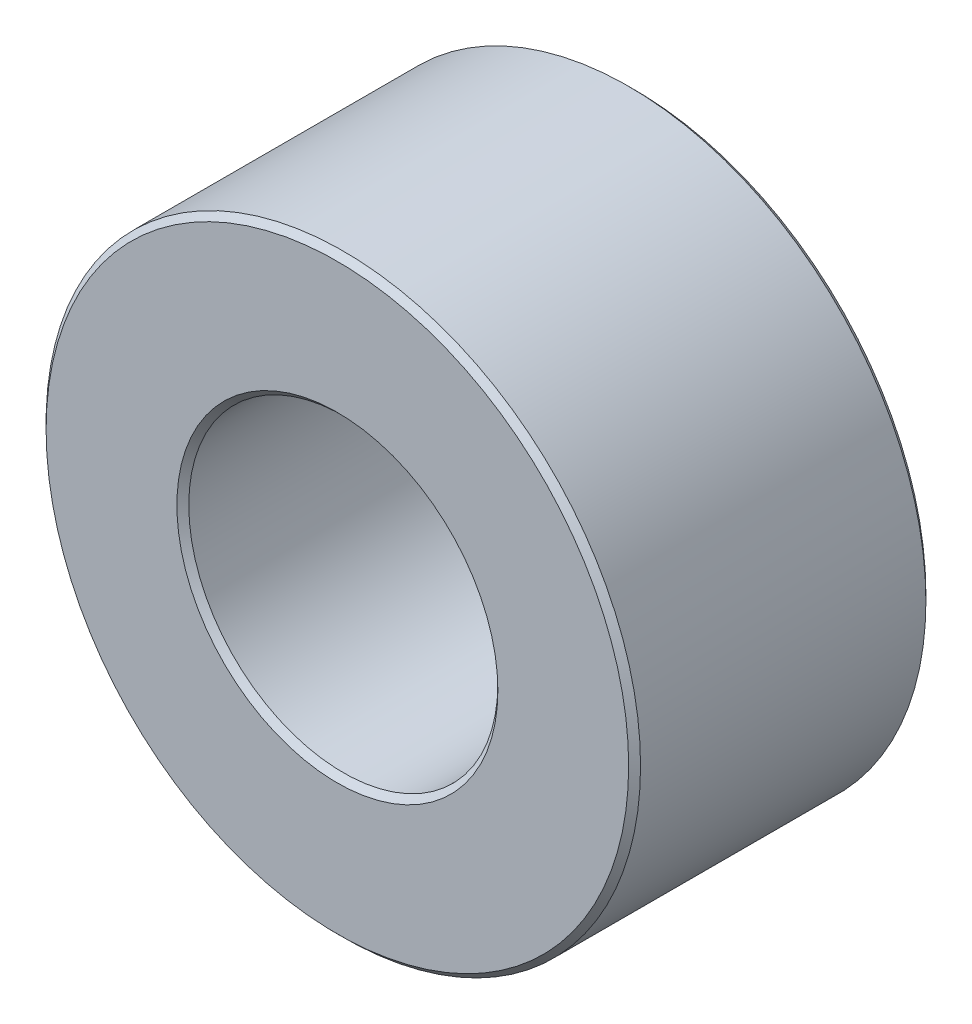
from build123d import *

# Parameters (mm, degrees)
SKETCH1_R           = 5
SKETCH1_R_2         = 2.6
BOSS_EXTRUDE2_DEPTH = 2.5
CHAMFER3_SIZE       = 0.1


with BuildPart() as part:
    # Sketch1 → Boss-Extrude2 (new, symmetric)
    with BuildSketch(Plane.XY):
        Circle(SKETCH1_R)
        Circle(SKETCH1_R_2, mode=Mode.SUBTRACT)
    extrude(amount=BOSS_EXTRUDE2_DEPTH, both=True)

    # Chamfer3
    chamfer3_edges = [part.edges().sort_by_distance(p)[0] for p in [
        (-5, 0, -2.5),
        (-5, 0, 2.5),
        (-2.6, 0, -2.5),
        (-2.6, 0, 2.5),
    ]]
    chamfer(chamfer3_edges, length=CHAMFER3_SIZE)


solid = part.part
